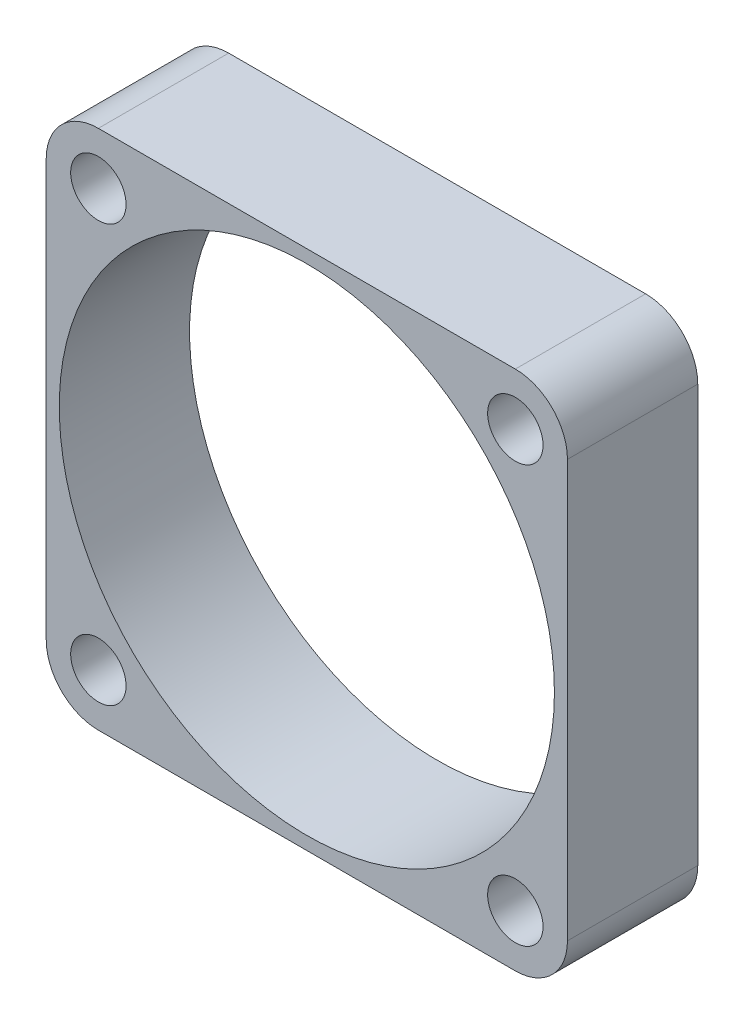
from build123d import *

# Parameters (mm, degrees)
ESQUISSE1_W        = 40
ESQUISSE1_H        = 40
ESQUISSE1_R        = 19
ESQUISSE1_R_2      = 2.125
BOSS_EXTRU_1_DEPTH = 10
CONG_1_R           = 4


with BuildPart() as part:
    # Esquisse1 → Boss.-Extru.1 (new body)
    with BuildSketch(Plane.XY):
        with Locations((-38.63798459, 16)):
            Rectangle(ESQUISSE1_W, ESQUISSE1_H)
        with Locations((-38.63798459, 16)):
            Circle(ESQUISSE1_R, mode=Mode.SUBTRACT)
        with Locations((-54.63798459, 32)):
            Circle(ESQUISSE1_R_2, mode=Mode.SUBTRACT)
        with Locations((-22.63798459, 32)):
            Circle(ESQUISSE1_R_2, mode=Mode.SUBTRACT)
        with Locations((-54.63798459, 0)):
            Circle(ESQUISSE1_R_2, mode=Mode.SUBTRACT)
        with Locations((-22.63798459, 0)):
            Circle(ESQUISSE1_R_2, mode=Mode.SUBTRACT)
    extrude(amount=BOSS_EXTRU_1_DEPTH)

    # Cong_1
    cong_1_edges = [part.edges().sort_by_distance(p)[0] for p in [
        (-58.63798459, 36, 5),
        (-18.63798459, 36, 5),
        (-18.63798459, -4, 5),
        (-58.63798459, -4, 5),
    ]]
    fillet(cong_1_edges, radius=CONG_1_R)


solid = part.part
